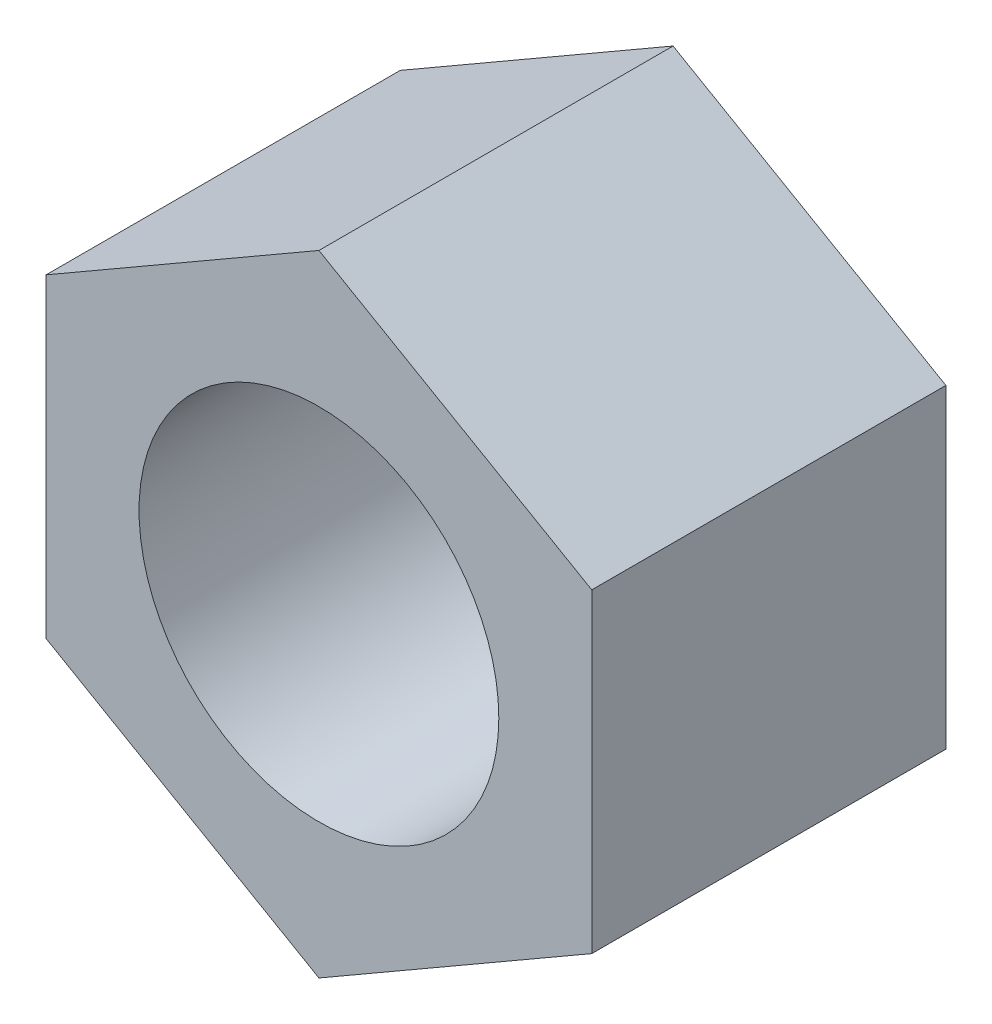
from build123d import *

# Parameters (mm, degrees)
SKETCH1_R      = 38.1
NUT_BODY_DEPTH = 75.0062


with BuildPart() as part:
    # Sketch1 → Nut body (new body)
    with BuildSketch(Plane(origin=(0, 0, 0), x_dir=(0, 1, 0), z_dir=(0, 0, 1))):
        Polygon((33.362185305, -57.785), (66.72437061, 0), (33.362185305, 57.785), (-33.362185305, 57.785), (-66.72437061, 0), (-33.362185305, -57.785), align=None)
        with Locations(Location((0, 0, 0), (0, 0, 270))):
            Circle(SKETCH1_R, mode=Mode.SUBTRACT)
    extrude(amount=NUT_BODY_DEPTH)


solid = part.part
